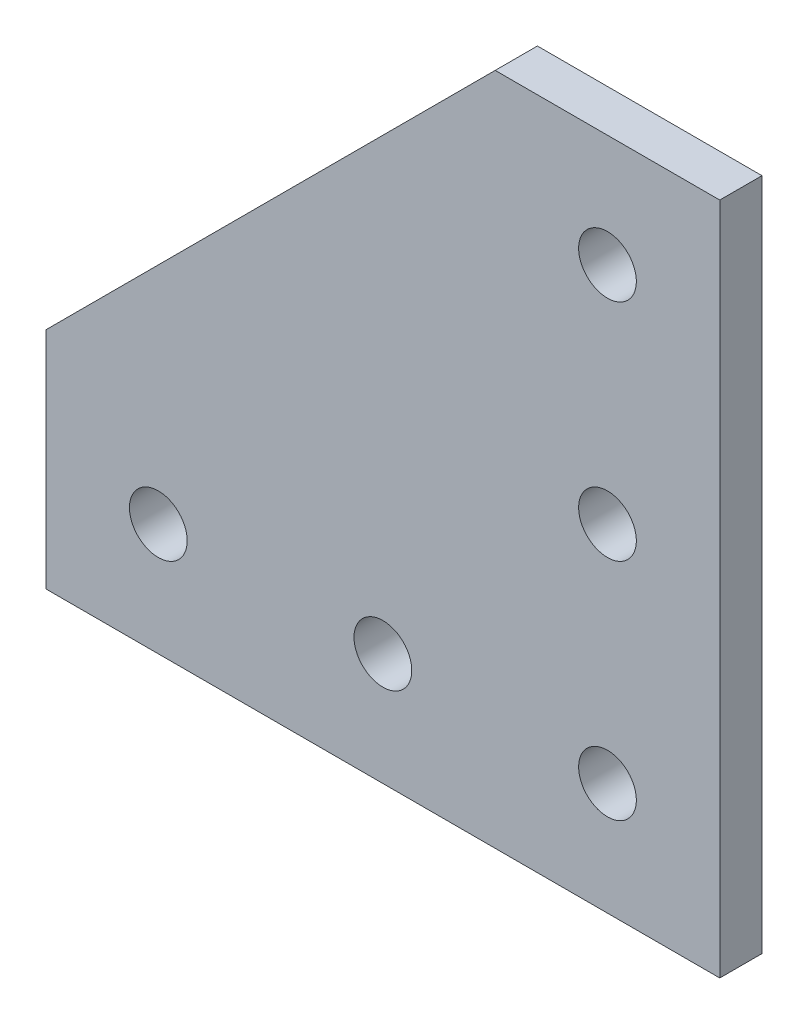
from build123d import *

# Parameters (mm, degrees)
SKETCH1_R           = 3.2639
BOSS_EXTRUDE1_DEPTH = 4.7752


with BuildPart() as part:
    # Sketch1 → Boss-Extrude1 (new body)
    with BuildSketch(Plane.XY.offset(4.7752)):
        Polygon((12.7, 76.2), (-38.1, 25.4), (-38.1, 0), (38.1, 0), (38.1, 76.2), align=None)
        with Locations(Location((-25.4, 12.7, 0), (0, 0, 180))):
            Circle(SKETCH1_R, mode=Mode.SUBTRACT)
        with Locations(Location((0, 12.7, 0), (0, 0, 180))):
            Circle(SKETCH1_R, mode=Mode.SUBTRACT)
        with Locations(Location((25.4, 63.5, 0), (0, 0, 180))):
            Circle(SKETCH1_R, mode=Mode.SUBTRACT)
        with Locations(Location((25.4, 38.1, 0), (0, 0, 180))):
            Circle(SKETCH1_R, mode=Mode.SUBTRACT)
        with Locations(Location((25.4, 12.7, 0), (0, 0, 180))):
            Circle(SKETCH1_R, mode=Mode.SUBTRACT)
    extrude(amount=-BOSS_EXTRUDE1_DEPTH)


solid = part.part
